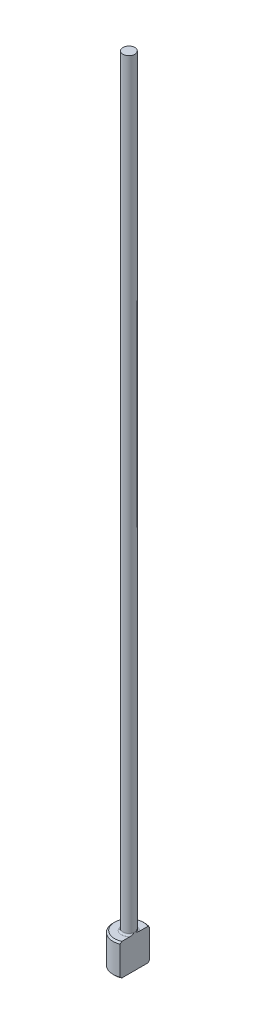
from build123d import *
from build123d.topology import SkipClean

# Parameters (mm, degrees)
CHAMFER1_SIZE    = 0.2
FILLET1_R        = 0.2
KEYED_HEAD_DEPTH = 101.039992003


with BuildPart() as part:
    # Sketch1 → Revolve1 (revolve)
    with BuildSketch(Plane.XY, mode=Mode.PRIVATE) as revolve1_sk:
        Polygon((0, 0), (-2, 0), (-2, 4), (-0.75, 4), (-0.75, 100), (0, 100), align=None)
    revolve(revolve1_sk.sketch.rotate(Axis((0, 259.958771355, 0), (0, -1, 0)), 270), axis=Axis((0, 259.958771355, 0), (0, -1, 0)))

    # Chamfer1
    chamfer1_edges = [part.edges().sort_by_distance(p)[0] for p in [
        (0, 4, -2),
        (0, 0, -2),
    ]]
    chamfer(chamfer1_edges, length=CHAMFER1_SIZE)

    # Fillet1
    fillet1_edges = [part.edges().sort_by_distance(p)[0] for p in [
        (0, 4, -0.75),
    ]]
    fillet(fillet1_edges, radius=FILLET1_R)

    # Sketch2 → KEYED HEAD (cut, through all)
    with SkipClean():  # the faces are left unmerged after this step: merging them gives an invalid solid
        with BuildSketch(Plane(origin=(0, 0, 0), x_dir=(1, 0, 0), z_dir=(0, 1, 0))):
            with BuildLine():
                Line((0.75, -1.854049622), (0.75, 1.854049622))
                ThreePointArc((0.75, 1.854049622), (2, 0), (0.75, -1.854049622))
            make_face()
        extrude(amount=KEYED_HEAD_DEPTH, mode=Mode.SUBTRACT)


solid = part.part
